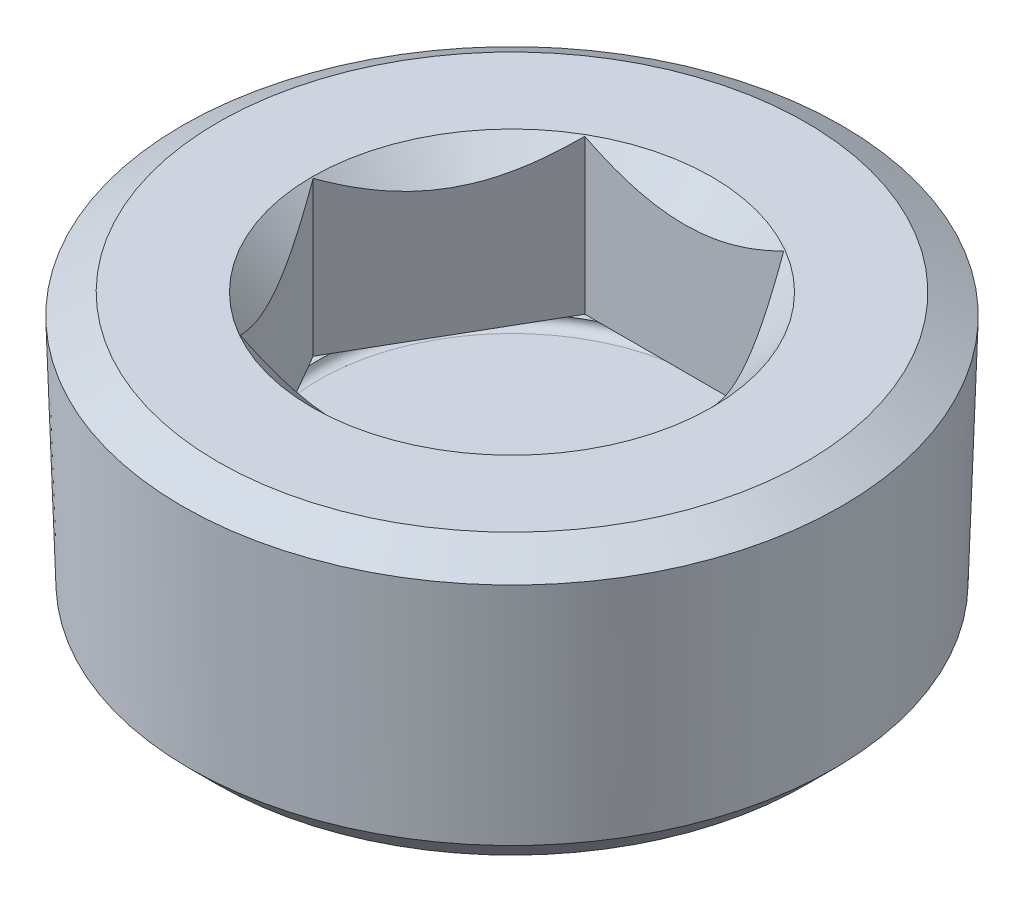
from build123d import *

# Parameters (mm, degrees)
CUT_EXTRUDE1_START = -11.43
CUT_EXTRUDE1_DEPTH = 11.362697


with BuildPart() as part:
    # Sketch2 → Revolve1 (revolve)
    with BuildSketch(Plane.XY, mode=Mode.PRIVATE) as revolve1_sk:
        Polygon((0, 0), (-21.682763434, 0), (-24.311227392, -1.517544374), (-23.780239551, -18.527323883), (-21.682763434, -20.6248), (0, -20.6248), align=None)
    revolve(revolve1_sk.sketch.rotate(Axis((0, 10.744282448, 0), (0, -1, 0)), 270), axis=Axis((0, 10.744282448, 0), (0, -1, 0)))

    # Sketch3 → Cut-Revolve1 (revolve, cut)
    with BuildSketch(Plane.XY, mode=Mode.PRIVATE) as cut_revolve1_sk:
        with BuildLine():
            Line((0, 0), (-14.732, 0))
            Line((-14.732, 0), (-12.7, -2.032))
            Line((-12.7, -2.032), (-12.7, -11.43))
            Line((-12.7, -11.43), (-14.224, -11.43))
            ThreePointArc((-14.224, -11.43), (-14.859, -12.065), (-14.224, -12.7))
            Line((-14.224, -12.7), (0, -12.7))
            Line((0, -12.7), (0, 0))
        make_face()
    revolve(cut_revolve1_sk.sketch.rotate(Axis((0, 2.934222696, 0), (0, -1, 0)), 270), axis=Axis((0, 2.934222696, 0), (0, -1, 0)), mode=Mode.SUBTRACT)

    # Sketch4 → Cut-Extrude1 (cut)
    with BuildSketch(Plane(origin=(0, 0, 0), x_dir=(1, 0, 0), z_dir=(0, 1, 0)).offset(CUT_EXTRUDE1_START)):
        Polygon((-7.332348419, -12.7), (7.332348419, -12.7), (14.664696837, 0), (7.332348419, 12.7), (-7.332348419, 12.7), (-14.664696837, 0), align=None)
    extrude(amount=CUT_EXTRUDE1_DEPTH, mode=Mode.SUBTRACT)


solid = part.part
